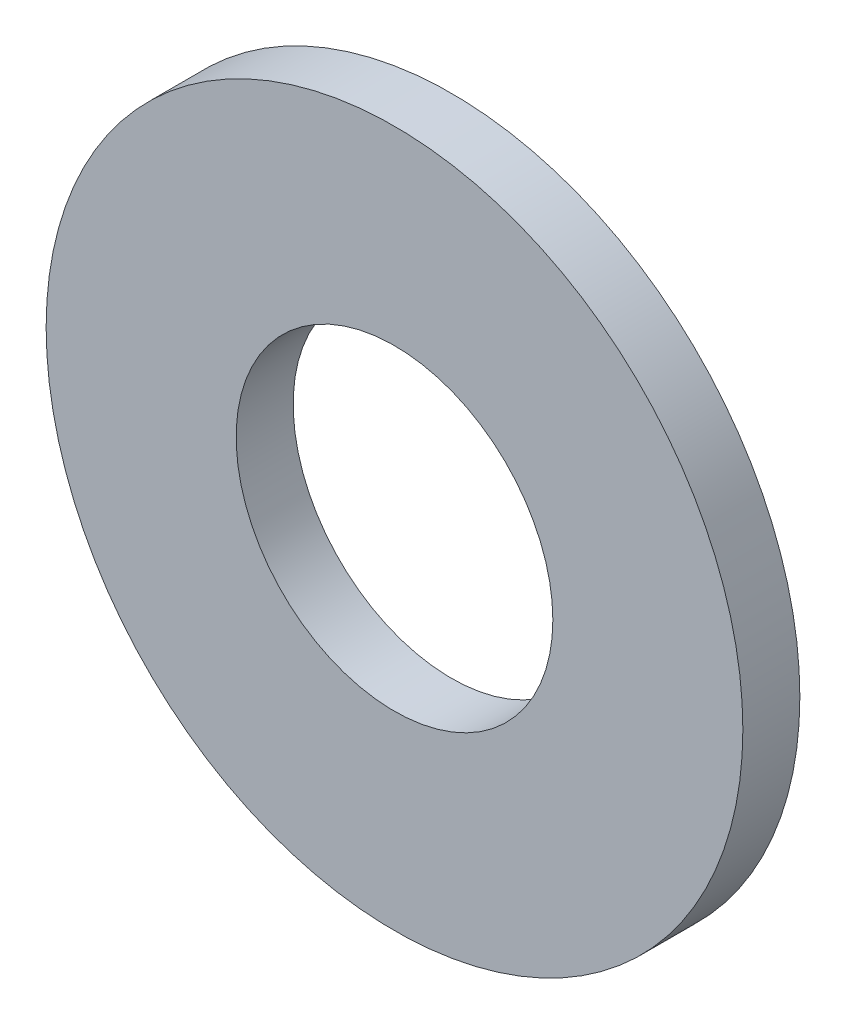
ISO-10303-21;
HEADER;
FILE_DESCRIPTION(('STEP AP214'),'2;1');
FILE_NAME('part.step','',(''),(''),'','','');
FILE_SCHEMA(('AUTOMOTIVE_DESIGN { 1 0 10303 214 1 1 1 1 }'));
ENDSEC;
DATA;
#1=APPLICATION_CONTEXT('core data for automotive mechanical design processes');
#2=APPLICATION_PROTOCOL_DEFINITION('international standard','automotive_design',2000,#1);
#3=PRODUCT_CONTEXT('',#1,'mechanical');
#4=PRODUCT('Part','Part','',(#3));
#5=PRODUCT_RELATED_PRODUCT_CATEGORY('part','',(#4));
#6=PRODUCT_DEFINITION_FORMATION('','',#4);
#7=PRODUCT_DEFINITION_CONTEXT('part definition',#1,'design');
#8=PRODUCT_DEFINITION('design','',#6,#7);
#9=PRODUCT_DEFINITION_SHAPE('','',#8);
#10=(LENGTH_UNIT() NAMED_UNIT(*) SI_UNIT(.MILLI.,.METRE.));
#11=(NAMED_UNIT(*) PLANE_ANGLE_UNIT() SI_UNIT($,.RADIAN.));
#12=(NAMED_UNIT(*) SI_UNIT($,.STERADIAN.) SOLID_ANGLE_UNIT());
#13=UNCERTAINTY_MEASURE_WITH_UNIT(LENGTH_MEASURE(1.E-05),#10,'distance_accuracy_value','');
#14=(GEOMETRIC_REPRESENTATION_CONTEXT(3) GLOBAL_UNCERTAINTY_ASSIGNED_CONTEXT((#13)) GLOBAL_UNIT_ASSIGNED_CONTEXT((#10,
#11,#12)) REPRESENTATION_CONTEXT('',''));
#15=CARTESIAN_POINT('',(0.,0.,0.));
#16=DIRECTION('',(0.,0.,1.));
#17=DIRECTION('',(1.,0.,0.));
#18=AXIS2_PLACEMENT_3D('',#15,#16,#17);
#19=CARTESIAN_POINT('',(0.,0.,1.8));
#20=DIRECTION('',(0.,0.,1.));
#21=DIRECTION('',(1.,0.,0.));
#22=AXIS2_PLACEMENT_3D('',#19,#20,#21);
#23=PLANE('',#22);
#24=CARTESIAN_POINT('',(0.,0.,1.8));
#25=DIRECTION('',(0.,0.,1.));
#26=DIRECTION('',(1.,0.,0.));
#27=AXIS2_PLACEMENT_3D('',#24,#25,#26);
#28=CIRCLE('',#27,11.);
#29=CARTESIAN_POINT('',(11.,0.,1.8));
#30=VERTEX_POINT('',#29);
#31=EDGE_CURVE('E10',#30,#30,#28,.T.);
#32=ORIENTED_EDGE('',*,*,#31,.T.);
#33=EDGE_LOOP('',(#32));
#34=FACE_BOUND('',#33,.T.);
#35=CARTESIAN_POINT('',(0.,0.,1.8));
#36=DIRECTION('',(0.,0.,1.));
#37=DIRECTION('',(1.,0.,0.));
#38=AXIS2_PLACEMENT_3D('',#35,#36,#37);
#39=CIRCLE('',#38,5.);
#40=CARTESIAN_POINT('',(5.,0.,1.8));
#41=VERTEX_POINT('',#40);
#42=EDGE_CURVE('E40',#41,#41,#39,.T.);
#43=ORIENTED_EDGE('',*,*,#42,.F.);
#44=EDGE_LOOP('',(#43));
#45=FACE_BOUND('',#44,.T.);
#46=ADVANCED_FACE('F29',(#34,#45),#23,.T.);
#47=CARTESIAN_POINT('',(0.,0.,0.));
#48=DIRECTION('',(0.,0.,1.));
#49=DIRECTION('',(1.,0.,0.));
#50=AXIS2_PLACEMENT_3D('',#47,#48,#49);
#51=PLANE('',#50);
#52=CARTESIAN_POINT('',(0.,0.,0.));
#53=DIRECTION('',(0.,0.,1.));
#54=DIRECTION('',(1.,0.,0.));
#55=AXIS2_PLACEMENT_3D('',#52,#53,#54);
#56=CIRCLE('',#55,11.);
#57=CARTESIAN_POINT('',(11.,0.,0.));
#58=VERTEX_POINT('',#57);
#59=EDGE_CURVE('E33',#58,#58,#56,.T.);
#60=ORIENTED_EDGE('',*,*,#59,.F.);
#61=EDGE_LOOP('',(#60));
#62=FACE_BOUND('',#61,.T.);
#63=CARTESIAN_POINT('',(0.,0.,0.));
#64=DIRECTION('',(0.,0.,1.));
#65=DIRECTION('',(1.,0.,0.));
#66=AXIS2_PLACEMENT_3D('',#63,#64,#65);
#67=CIRCLE('',#66,5.);
#68=CARTESIAN_POINT('',(5.,0.,0.));
#69=VERTEX_POINT('',#68);
#70=EDGE_CURVE('E42',#69,#69,#67,.T.);
#71=ORIENTED_EDGE('',*,*,#70,.T.);
#72=EDGE_LOOP('',(#71));
#73=FACE_BOUND('',#72,.T.);
#74=ADVANCED_FACE('F52',(#62,#73),#51,.F.);
#75=CARTESIAN_POINT('',(0.,0.,1.8));
#76=DIRECTION('',(0.,0.,-1.));
#77=DIRECTION('',(-1.,0.,0.));
#78=AXIS2_PLACEMENT_3D('',#75,#76,#77);
#79=CYLINDRICAL_SURFACE('',#78,11.);
#80=ORIENTED_EDGE('',*,*,#31,.F.);
#81=EDGE_LOOP('',(#80));
#82=FACE_BOUND('',#81,.T.);
#83=ORIENTED_EDGE('',*,*,#59,.T.);
#84=EDGE_LOOP('',(#83));
#85=FACE_BOUND('',#84,.T.);
#86=ADVANCED_FACE('F31',(#82,#85),#79,.T.);
#87=CARTESIAN_POINT('',(0.,0.,1.8));
#88=DIRECTION('',(0.,0.,-1.));
#89=DIRECTION('',(-1.,0.,0.));
#90=AXIS2_PLACEMENT_3D('',#87,#88,#89);
#91=CYLINDRICAL_SURFACE('',#90,5.);
#92=ORIENTED_EDGE('',*,*,#42,.T.);
#93=EDGE_LOOP('',(#92));
#94=FACE_BOUND('',#93,.T.);
#95=ORIENTED_EDGE('',*,*,#70,.F.);
#96=EDGE_LOOP('',(#95));
#97=FACE_BOUND('',#96,.T.);
#98=ADVANCED_FACE('F48',(#94,#97),#91,.F.);
#99=CLOSED_SHELL('',(#46,#74,#86,#98));
#100=MANIFOLD_SOLID_BREP('B2',#99);
#101=ADVANCED_BREP_SHAPE_REPRESENTATION('',(#18,#100),#14);
#102=SHAPE_DEFINITION_REPRESENTATION(#9,#101);
ENDSEC;
END-ISO-10303-21;
